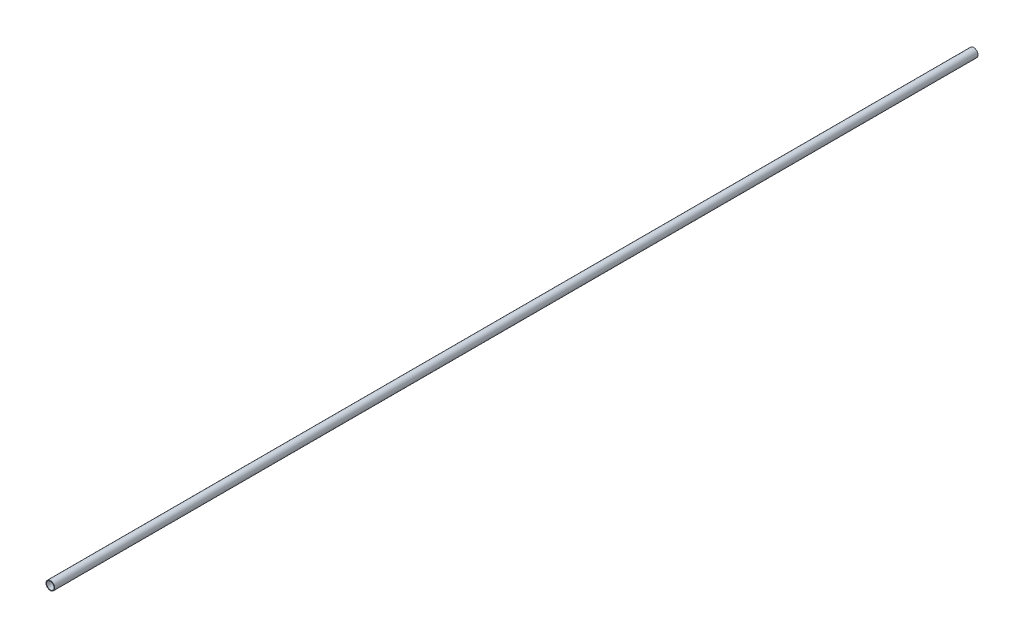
from build123d import *

# Parameters (mm, degrees)
SKETCH1_R           = 9.525
SKETCH1_R_2         = 8.255
BOSS_EXTRUDE1_DEPTH = 2032


with BuildPart() as part:
    # Sketch1 → Boss-Extrude1 (new body)
    with BuildSketch(Plane.XY):
        Circle(SKETCH1_R)
        Circle(SKETCH1_R_2, mode=Mode.SUBTRACT)
    extrude(amount=BOSS_EXTRUDE1_DEPTH)


solid = part.part
